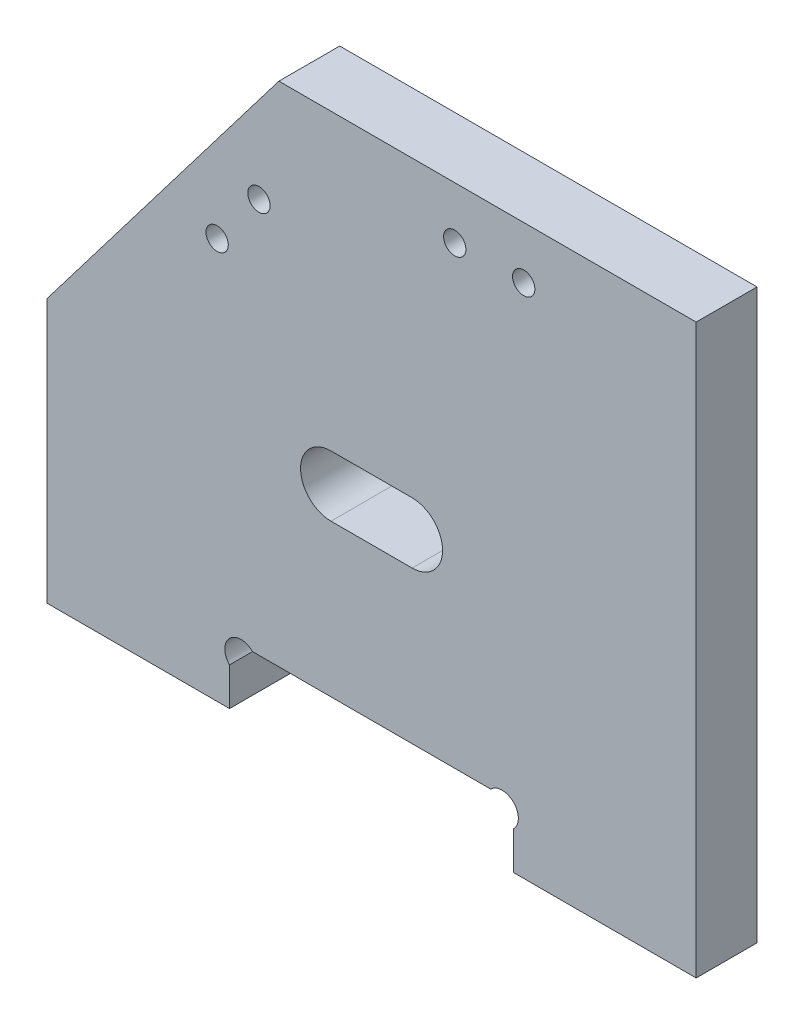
from build123d import *

# Parameters (mm, degrees)
ESQUISSE1_R        = 1.1
BOSS_EXTRU_1_DEPTH = 6


with BuildPart() as part:
    # Esquisse1 → Boss.-Extru.1 (new body)
    with BuildSketch(Plane.XY):
        with BuildLine():
            Line((-43.7372583, 6), (-20.2627417, 6))
            ThreePointArc((-20.2627417, 6), (-18, 6), (-18, 3.7372583))
            Line((-18, 3.7372583), (-18, 0))
            Line((-18, 0), (0, 0))
            Line((0, 0), (0, 56))
            Line((0, 56), (-41.137848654, 56))
            Line((-41.137848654, 56), (-64, 26))
            Line((-64, 26), (-64, 0))
            Line((-64, 0), (-46, 0))
            Line((-46, 0), (-46, 3.7372583))
            ThreePointArc((-46, 3.7372583), (-46, 6), (-43.7372583, 6))
        make_face()
        with Locations((-47.224642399, 39.516267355)):
            Circle(ESQUISSE1_R, mode=Mode.SUBTRACT)
        with Locations((-43.102977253, 44.924767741)):
            Circle(ESQUISSE1_R, mode=Mode.SUBTRACT)
        with Locations((-23.8, 50.85)):
            Circle(ESQUISSE1_R, mode=Mode.SUBTRACT)
        with Locations((-17, 50.85)):
            Circle(ESQUISSE1_R, mode=Mode.SUBTRACT)
        with BuildLine():
            Line((-36, 27), (-28, 27))
            ThreePointArc((-28, 27), (-25, 24), (-28, 21))
            Line((-28, 21), (-36, 21))
            ThreePointArc((-36, 21), (-39, 24), (-36, 27))
        make_face(mode=Mode.SUBTRACT)
    extrude(amount=BOSS_EXTRU_1_DEPTH)


solid = part.part
